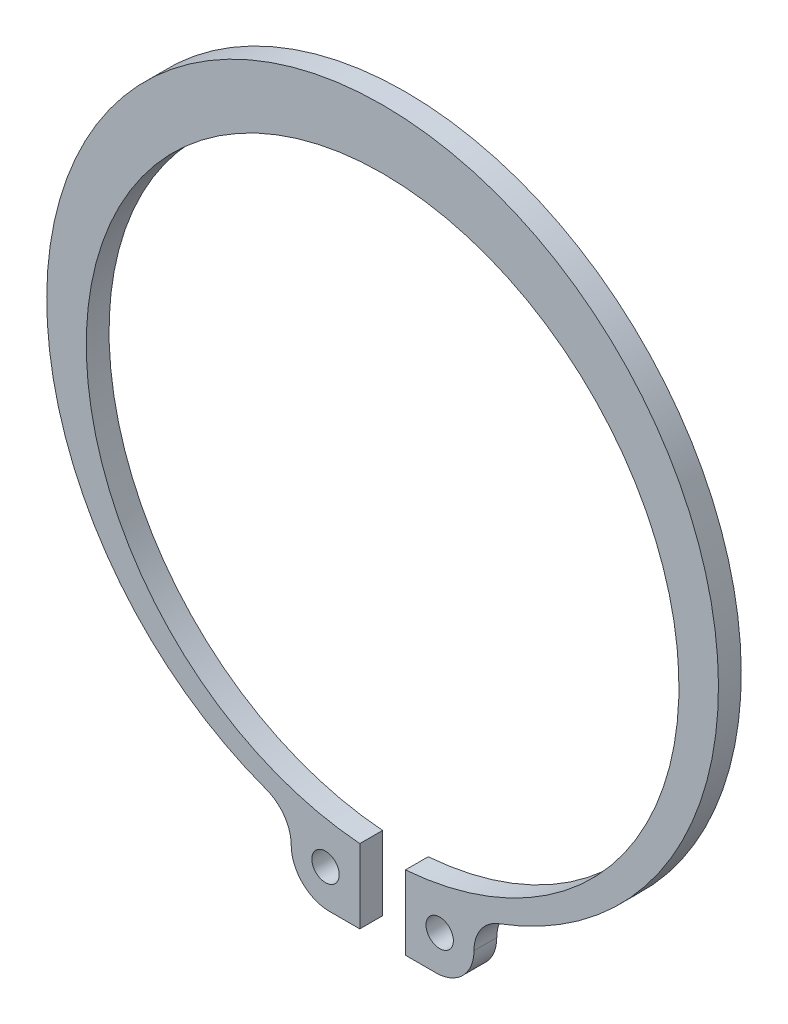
ISO-10303-21;
HEADER;
FILE_DESCRIPTION(('STEP AP214'),'2;1');
FILE_NAME('part.step','',(''),(''),'','','');
FILE_SCHEMA(('AUTOMOTIVE_DESIGN { 1 0 10303 214 1 1 1 1 }'));
ENDSEC;
DATA;
#1=APPLICATION_CONTEXT('core data for automotive mechanical design processes');
#2=APPLICATION_PROTOCOL_DEFINITION('international standard','automotive_design',2000,#1);
#3=PRODUCT_CONTEXT('',#1,'mechanical');
#4=PRODUCT('Part','Part','',(#3));
#5=PRODUCT_RELATED_PRODUCT_CATEGORY('part','',(#4));
#6=PRODUCT_DEFINITION_FORMATION('','',#4);
#7=PRODUCT_DEFINITION_CONTEXT('part definition',#1,'design');
#8=PRODUCT_DEFINITION('design','',#6,#7);
#9=PRODUCT_DEFINITION_SHAPE('','',#8);
#10=(LENGTH_UNIT() NAMED_UNIT(*) SI_UNIT(.MILLI.,.METRE.));
#11=(NAMED_UNIT(*) PLANE_ANGLE_UNIT() SI_UNIT($,.RADIAN.));
#12=(NAMED_UNIT(*) SI_UNIT($,.STERADIAN.) SOLID_ANGLE_UNIT());
#13=UNCERTAINTY_MEASURE_WITH_UNIT(LENGTH_MEASURE(1.E-05),#10,'distance_accuracy_value','');
#14=(GEOMETRIC_REPRESENTATION_CONTEXT(3) GLOBAL_UNCERTAINTY_ASSIGNED_CONTEXT((#13)) GLOBAL_UNIT_ASSIGNED_CONTEXT((#10,
#11,#12)) REPRESENTATION_CONTEXT('',''));
#15=CARTESIAN_POINT('',(0.,0.,0.));
#16=DIRECTION('',(0.,0.,1.));
#17=DIRECTION('',(1.,0.,0.));
#18=AXIS2_PLACEMENT_3D('',#15,#16,#17);
#19=CARTESIAN_POINT('',(-10.0218401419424,-36.3237034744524,0.));
#20=DIRECTION('',(-1.,0.,0.));
#21=DIRECTION('',(0.,0.,1.));
#22=AXIS2_PLACEMENT_3D('',#19,#20,#21);
#23=PLANE('',#22);
#24=DIRECTION('',(0.,1.,0.));
#25=VECTOR('',#24,1.);
#26=CARTESIAN_POINT('',(-10.0218401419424,-36.3237034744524,0.));
#27=LINE('',#26,#25);
#28=CARTESIAN_POINT('',(-10.0218401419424,-36.3137034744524,0.));
#29=VERTEX_POINT('',#28);
#30=CARTESIAN_POINT('',(-10.0218401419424,-36.3237034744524,0.));
#31=VERTEX_POINT('',#30);
#32=EDGE_CURVE('E126',#29,#31,#27,.F.);
#33=ORIENTED_EDGE('',*,*,#32,.T.);
#34=DIRECTION('',(0.,0.,1.));
#35=VECTOR('',#34,1.);
#36=CARTESIAN_POINT('',(-10.0218401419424,-36.3237034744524,0.));
#37=LINE('',#36,#35);
#38=CARTESIAN_POINT('',(-10.0218401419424,-36.3237034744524,2.5));
#39=VERTEX_POINT('',#38);
#40=EDGE_CURVE('E148',#39,#31,#37,.F.);
#41=ORIENTED_EDGE('',*,*,#40,.F.);
#42=DIRECTION('',(0.,1.,0.));
#43=VECTOR('',#42,1.);
#44=CARTESIAN_POINT('',(-10.0218401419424,-3.40089522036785,2.5));
#45=LINE('',#44,#43);
#46=CARTESIAN_POINT('',(-10.0218401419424,-36.3137034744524,2.5));
#47=VERTEX_POINT('',#46);
#48=EDGE_CURVE('E125',#47,#39,#45,.F.);
#49=ORIENTED_EDGE('',*,*,#48,.F.);
#50=DIRECTION('',(0.,0.,1.));
#51=VECTOR('',#50,1.);
#52=CARTESIAN_POINT('',(-10.0218401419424,-36.3137034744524,0.));
#53=LINE('',#52,#51);
#54=EDGE_CURVE('E97',#47,#29,#53,.F.);
#55=ORIENTED_EDGE('',*,*,#54,.T.);
#56=EDGE_LOOP('',(#33,#41,#49,#55));
#57=FACE_BOUND('',#56,.T.);
#58=ADVANCED_FACE('F16',(#57),#23,.T.);
#59=CARTESIAN_POINT('',(10.0218401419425,-36.3137034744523,0.));
#60=DIRECTION('',(1.,0.,0.));
#61=DIRECTION('',(0.,0.,-1.));
#62=AXIS2_PLACEMENT_3D('',#59,#60,#61);
#63=PLANE('',#62);
#64=DIRECTION('',(0.,1.,0.));
#65=VECTOR('',#64,1.);
#66=CARTESIAN_POINT('',(10.0218401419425,-36.3137034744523,0.));
#67=LINE('',#66,#65);
#68=CARTESIAN_POINT('',(10.0218401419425,-36.3237034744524,0.));
#69=VERTEX_POINT('',#68);
#70=CARTESIAN_POINT('',(10.0218401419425,-36.3137034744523,0.));
#71=VERTEX_POINT('',#70);
#72=EDGE_CURVE('E123',#69,#71,#67,.T.);
#73=ORIENTED_EDGE('',*,*,#72,.T.);
#74=DIRECTION('',(0.,0.,1.));
#75=VECTOR('',#74,1.);
#76=CARTESIAN_POINT('',(10.0218401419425,-36.3137034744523,0.));
#77=LINE('',#76,#75);
#78=CARTESIAN_POINT('',(10.0218401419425,-36.3137034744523,2.5));
#79=VERTEX_POINT('',#78);
#80=EDGE_CURVE('E179',#71,#79,#77,.T.);
#81=ORIENTED_EDGE('',*,*,#80,.T.);
#82=DIRECTION('',(0.,1.,0.));
#83=VECTOR('',#82,1.);
#84=CARTESIAN_POINT('',(10.0218401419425,-3.40089522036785,2.5));
#85=LINE('',#84,#83);
#86=CARTESIAN_POINT('',(10.0218401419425,-36.3237034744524,2.5));
#87=VERTEX_POINT('',#86);
#88=EDGE_CURVE('E119',#87,#79,#85,.T.);
#89=ORIENTED_EDGE('',*,*,#88,.F.);
#90=DIRECTION('',(0.,0.,1.));
#91=VECTOR('',#90,1.);
#92=CARTESIAN_POINT('',(10.0218401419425,-36.3237034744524,0.));
#93=LINE('',#92,#91);
#94=EDGE_CURVE('E206',#69,#87,#93,.T.);
#95=ORIENTED_EDGE('',*,*,#94,.F.);
#96=EDGE_LOOP('',(#73,#81,#89,#95));
#97=FACE_BOUND('',#96,.T.);
#98=ADVANCED_FACE('F236',(#97),#63,.T.);
#99=CARTESIAN_POINT('',(0.,-3.40089522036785,2.5));
#100=DIRECTION('',(0.,0.,1.));
#101=DIRECTION('',(1.,0.,0.));
#102=AXIS2_PLACEMENT_3D('',#99,#100,#101);
#103=PLANE('',#102);
#104=CARTESIAN_POINT('',(6.26092007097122,-36.5,2.5));
#105=DIRECTION('',(0.,0.,1.));
#106=DIRECTION('',(1.,0.,0.));
#107=AXIS2_PLACEMENT_3D('',#104,#105,#106);
#108=CIRCLE('',#107,1.5);
#109=CARTESIAN_POINT('',(7.76092007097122,-36.5,2.5));
#110=VERTEX_POINT('',#109);
#111=EDGE_CURVE('E172',#110,#110,#108,.F.);
#112=ORIENTED_EDGE('',*,*,#111,.T.);
#113=EDGE_LOOP('',(#112));
#114=FACE_BOUND('',#113,.T.);
#115=CARTESIAN_POINT('',(-6.26092007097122,-36.5,2.5));
#116=DIRECTION('',(0.,0.,1.));
#117=DIRECTION('',(1.,0.,0.));
#118=AXIS2_PLACEMENT_3D('',#115,#116,#117);
#119=CIRCLE('',#118,1.5);
#120=CARTESIAN_POINT('',(-4.76092007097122,-36.5,2.5));
#121=VERTEX_POINT('',#120);
#122=EDGE_CURVE('E175',#121,#121,#119,.F.);
#123=ORIENTED_EDGE('',*,*,#122,.T.);
#124=EDGE_LOOP('',(#123));
#125=FACE_BOUND('',#124,.T.);
#126=CARTESIAN_POINT('',(5.83554361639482,-36.3237034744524,2.5));
#127=DIRECTION('',(0.,0.,1.));
#128=DIRECTION('',(1.,0.,0.));
#129=AXIS2_PLACEMENT_3D('',#126,#127,#128);
#130=CIRCLE('',#129,4.18629652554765);
#131=CARTESIAN_POINT('',(5.83554361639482,-40.51,2.5));
#132=VERTEX_POINT('',#131);
#133=EDGE_CURVE('E180',#87,#132,#130,.F.);
#134=ORIENTED_EDGE('',*,*,#133,.F.);
#135=ORIENTED_EDGE('',*,*,#88,.T.);
#136=CARTESIAN_POINT('',(14.2081366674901,-36.3137034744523,2.5));
#137=DIRECTION('',(0.,0.,1.));
#138=DIRECTION('',(1.,0.,0.));
#139=AXIS2_PLACEMENT_3D('',#136,#137,#138);
#140=CIRCLE('',#139,4.18629652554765);
#141=CARTESIAN_POINT('',(12.7581120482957,-32.3865534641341,2.5));
#142=VERTEX_POINT('',#141);
#143=EDGE_CURVE('E107',#79,#142,#140,.F.);
#144=ORIENTED_EDGE('',*,*,#143,.T.);
#145=CARTESIAN_POINT('',(0.,2.16666666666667,2.5));
#146=DIRECTION('',(0.,0.,1.));
#147=DIRECTION('',(1.,0.,0.));
#148=AXIS2_PLACEMENT_3D('',#145,#146,#147);
#149=CIRCLE('',#148,36.8333333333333);
#150=CARTESIAN_POINT('',(-12.7581120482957,-32.3865534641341,2.5));
#151=VERTEX_POINT('',#150);
#152=EDGE_CURVE('E103',#151,#142,#149,.F.);
#153=ORIENTED_EDGE('',*,*,#152,.F.);
#154=CARTESIAN_POINT('',(-14.2081366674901,-36.3137034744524,2.5));
#155=DIRECTION('',(0.,0.,1.));
#156=DIRECTION('',(1.,0.,0.));
#157=AXIS2_PLACEMENT_3D('',#154,#155,#156);
#158=CIRCLE('',#157,4.18629652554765);
#159=EDGE_CURVE('E20',#151,#47,#158,.F.);
#160=ORIENTED_EDGE('',*,*,#159,.T.);
#161=ORIENTED_EDGE('',*,*,#48,.T.);
#162=CARTESIAN_POINT('',(-5.83554361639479,-36.3237034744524,2.5));
#163=DIRECTION('',(0.,0.,1.));
#164=DIRECTION('',(1.,0.,0.));
#165=AXIS2_PLACEMENT_3D('',#162,#163,#164);
#166=CIRCLE('',#165,4.18629652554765);
#167=CARTESIAN_POINT('',(-5.83554361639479,-40.51,2.5));
#168=VERTEX_POINT('',#167);
#169=EDGE_CURVE('E116',#168,#39,#166,.F.);
#170=ORIENTED_EDGE('',*,*,#169,.F.);
#171=DIRECTION('',(1.,0.,0.));
#172=VECTOR('',#171,1.);
#173=CARTESIAN_POINT('',(-2.5,-40.51,2.5));
#174=LINE('',#173,#172);
#175=CARTESIAN_POINT('',(-2.50000000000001,-40.51,2.5));
#176=VERTEX_POINT('',#175);
#177=EDGE_CURVE('E146',#176,#168,#174,.F.);
#178=ORIENTED_EDGE('',*,*,#177,.F.);
#179=DIRECTION('',(0.,1.,0.));
#180=VECTOR('',#179,1.);
#181=CARTESIAN_POINT('',(-2.50000000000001,-32.4037034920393,2.5));
#182=LINE('',#181,#180);
#183=CARTESIAN_POINT('',(-2.50000000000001,-32.4037034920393,2.5));
#184=VERTEX_POINT('',#183);
#185=EDGE_CURVE('E139',#184,#176,#182,.F.);
#186=ORIENTED_EDGE('',*,*,#185,.F.);
#187=CARTESIAN_POINT('',(0.,0.,2.5));
#188=DIRECTION('',(0.,0.,1.));
#189=DIRECTION('',(1.,0.,0.));
#190=AXIS2_PLACEMENT_3D('',#187,#188,#189);
#191=CIRCLE('',#190,32.5);
#192=CARTESIAN_POINT('',(2.5,-32.4037034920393,2.5));
#193=VERTEX_POINT('',#192);
#194=EDGE_CURVE('E136',#184,#193,#191,.F.);
#195=ORIENTED_EDGE('',*,*,#194,.T.);
#196=DIRECTION('',(0.,1.,0.));
#197=VECTOR('',#196,1.);
#198=CARTESIAN_POINT('',(2.5,-40.51,2.5));
#199=LINE('',#198,#197);
#200=CARTESIAN_POINT('',(2.5,-40.51,2.5));
#201=VERTEX_POINT('',#200);
#202=EDGE_CURVE('E134',#201,#193,#199,.T.);
#203=ORIENTED_EDGE('',*,*,#202,.F.);
#204=DIRECTION('',(1.,0.,0.));
#205=VECTOR('',#204,1.);
#206=CARTESIAN_POINT('',(5.83554361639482,-40.51,2.5));
#207=LINE('',#206,#205);
#208=EDGE_CURVE('E127',#132,#201,#207,.F.);
#209=ORIENTED_EDGE('',*,*,#208,.F.);
#210=EDGE_LOOP('',(#134,#135,#144,#153,#160,#161,#170,#178,#186,#195,#203,#209));
#211=FACE_BOUND('',#210,.T.);
#212=ADVANCED_FACE('F105',(#114,#125,#211),#103,.T.);
#213=CARTESIAN_POINT('',(-14.2081366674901,-36.3137034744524,0.));
#214=DIRECTION('',(0.,0.,1.));
#215=DIRECTION('',(1.,0.,0.));
#216=AXIS2_PLACEMENT_3D('',#213,#214,#215);
#217=CYLINDRICAL_SURFACE('',#216,4.18629652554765);
#218=DIRECTION('',(0.,0.,1.));
#219=VECTOR('',#218,1.);
#220=CARTESIAN_POINT('',(-12.7581120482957,-32.3865534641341,0.));
#221=LINE('',#220,#219);
#222=CARTESIAN_POINT('',(-12.7581120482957,-32.3865534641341,0.));
#223=VERTEX_POINT('',#222);
#224=EDGE_CURVE('E115',#223,#151,#221,.T.);
#225=ORIENTED_EDGE('',*,*,#224,.F.);
#226=CARTESIAN_POINT('',(-14.2081366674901,-36.3137034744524,0.));
#227=DIRECTION('',(0.,0.,1.));
#228=DIRECTION('',(1.,0.,0.));
#229=AXIS2_PLACEMENT_3D('',#226,#227,#228);
#230=CIRCLE('',#229,4.18629652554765);
#231=EDGE_CURVE('E169',#223,#29,#230,.F.);
#232=ORIENTED_EDGE('',*,*,#231,.T.);
#233=ORIENTED_EDGE('',*,*,#54,.F.);
#234=ORIENTED_EDGE('',*,*,#159,.F.);
#235=EDGE_LOOP('',(#225,#232,#233,#234));
#236=FACE_BOUND('',#235,.T.);
#237=ADVANCED_FACE('F114',(#236),#217,.F.);
#238=CARTESIAN_POINT('',(-5.83554361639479,-36.3237034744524,0.));
#239=DIRECTION('',(0.,0.,1.));
#240=DIRECTION('',(1.,0.,0.));
#241=AXIS2_PLACEMENT_3D('',#238,#239,#240);
#242=CYLINDRICAL_SURFACE('',#241,4.18629652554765);
#243=CARTESIAN_POINT('',(-5.83554361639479,-36.3237034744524,0.));
#244=DIRECTION('',(0.,0.,1.));
#245=DIRECTION('',(1.,0.,0.));
#246=AXIS2_PLACEMENT_3D('',#243,#244,#245);
#247=CIRCLE('',#246,4.18629652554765);
#248=CARTESIAN_POINT('',(-5.83554361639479,-40.51,0.));
#249=VERTEX_POINT('',#248);
#250=EDGE_CURVE('E165',#31,#249,#247,.T.);
#251=ORIENTED_EDGE('',*,*,#250,.T.);
#252=DIRECTION('',(0.,0.,-1.));
#253=VECTOR('',#252,1.);
#254=CARTESIAN_POINT('',(-5.83554361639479,-40.51,0.));
#255=LINE('',#254,#253);
#256=EDGE_CURVE('E143',#168,#249,#255,.T.);
#257=ORIENTED_EDGE('',*,*,#256,.F.);
#258=ORIENTED_EDGE('',*,*,#169,.T.);
#259=ORIENTED_EDGE('',*,*,#40,.T.);
#260=EDGE_LOOP('',(#251,#257,#258,#259));
#261=FACE_BOUND('',#260,.T.);
#262=ADVANCED_FACE('F261',(#261),#242,.T.);
#263=CARTESIAN_POINT('',(-2.5,-40.51,0.));
#264=DIRECTION('',(0.,-1.,0.));
#265=DIRECTION('',(0.,0.,-1.));
#266=AXIS2_PLACEMENT_3D('',#263,#264,#265);
#267=PLANE('',#266);
#268=DIRECTION('',(1.,0.,0.));
#269=VECTOR('',#268,1.);
#270=CARTESIAN_POINT('',(0.,-40.51,0.));
#271=LINE('',#270,#269);
#272=CARTESIAN_POINT('',(-2.5,-40.51,0.));
#273=VERTEX_POINT('',#272);
#274=EDGE_CURVE('E168',#249,#273,#271,.T.);
#275=ORIENTED_EDGE('',*,*,#274,.T.);
#276=DIRECTION('',(0.,0.,-1.));
#277=VECTOR('',#276,1.);
#278=CARTESIAN_POINT('',(-2.50000000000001,-40.51,0.));
#279=LINE('',#278,#277);
#280=EDGE_CURVE('E142',#176,#273,#279,.T.);
#281=ORIENTED_EDGE('',*,*,#280,.F.);
#282=ORIENTED_EDGE('',*,*,#177,.T.);
#283=ORIENTED_EDGE('',*,*,#256,.T.);
#284=EDGE_LOOP('',(#275,#281,#282,#283));
#285=FACE_BOUND('',#284,.T.);
#286=ADVANCED_FACE('F258',(#285),#267,.T.);
#287=CARTESIAN_POINT('',(-2.50000000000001,-32.4037034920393,0.));
#288=DIRECTION('',(1.,0.,0.));
#289=DIRECTION('',(0.,0.,-1.));
#290=AXIS2_PLACEMENT_3D('',#287,#288,#289);
#291=PLANE('',#290);
#292=DIRECTION('',(0.,1.,0.));
#293=VECTOR('',#292,1.);
#294=CARTESIAN_POINT('',(-2.5,-3.40089522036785,0.));
#295=LINE('',#294,#293);
#296=CARTESIAN_POINT('',(-2.5,-32.4037034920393,0.));
#297=VERTEX_POINT('',#296);
#298=EDGE_CURVE('E164',#273,#297,#295,.T.);
#299=ORIENTED_EDGE('',*,*,#298,.T.);
#300=DIRECTION('',(0.,0.,1.));
#301=VECTOR('',#300,1.);
#302=CARTESIAN_POINT('',(-2.50000000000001,-32.4037034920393,0.));
#303=LINE('',#302,#301);
#304=EDGE_CURVE('E184',#297,#184,#303,.T.);
#305=ORIENTED_EDGE('',*,*,#304,.T.);
#306=ORIENTED_EDGE('',*,*,#185,.T.);
#307=ORIENTED_EDGE('',*,*,#280,.T.);
#308=EDGE_LOOP('',(#299,#305,#306,#307));
#309=FACE_BOUND('',#308,.T.);
#310=ADVANCED_FACE('F254',(#309),#291,.T.);
#311=CARTESIAN_POINT('',(0.,0.,0.));
#312=DIRECTION('',(0.,0.,1.));
#313=DIRECTION('',(1.,0.,0.));
#314=AXIS2_PLACEMENT_3D('',#311,#312,#313);
#315=CYLINDRICAL_SURFACE('',#314,32.5);
#316=CARTESIAN_POINT('',(0.,0.,0.));
#317=DIRECTION('',(0.,0.,1.));
#318=DIRECTION('',(1.,0.,0.));
#319=AXIS2_PLACEMENT_3D('',#316,#317,#318);
#320=CIRCLE('',#319,32.5);
#321=CARTESIAN_POINT('',(2.50000000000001,-32.4037034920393,0.));
#322=VERTEX_POINT('',#321);
#323=EDGE_CURVE('E161',#297,#322,#320,.F.);
#324=ORIENTED_EDGE('',*,*,#323,.T.);
#325=DIRECTION('',(0.,0.,1.));
#326=VECTOR('',#325,1.);
#327=CARTESIAN_POINT('',(2.5,-32.4037034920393,0.));
#328=LINE('',#327,#326);
#329=EDGE_CURVE('E131',#193,#322,#328,.F.);
#330=ORIENTED_EDGE('',*,*,#329,.F.);
#331=ORIENTED_EDGE('',*,*,#194,.F.);
#332=ORIENTED_EDGE('',*,*,#304,.F.);
#333=EDGE_LOOP('',(#324,#330,#331,#332));
#334=FACE_BOUND('',#333,.T.);
#335=ADVANCED_FACE('F298',(#334),#315,.F.);
#336=CARTESIAN_POINT('',(2.5,-40.51,0.));
#337=DIRECTION('',(-1.,0.,0.));
#338=DIRECTION('',(0.,0.,1.));
#339=AXIS2_PLACEMENT_3D('',#336,#337,#338);
#340=PLANE('',#339);
#341=DIRECTION('',(0.,1.,0.));
#342=VECTOR('',#341,1.);
#343=CARTESIAN_POINT('',(2.50000000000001,-3.40089522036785,0.));
#344=LINE('',#343,#342);
#345=CARTESIAN_POINT('',(2.50000000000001,-40.51,0.));
#346=VERTEX_POINT('',#345);
#347=EDGE_CURVE('E163',#322,#346,#344,.F.);
#348=ORIENTED_EDGE('',*,*,#347,.T.);
#349=DIRECTION('',(0.,0.,-1.));
#350=VECTOR('',#349,1.);
#351=CARTESIAN_POINT('',(2.5,-40.51,0.));
#352=LINE('',#351,#350);
#353=EDGE_CURVE('E130',#201,#346,#352,.T.);
#354=ORIENTED_EDGE('',*,*,#353,.F.);
#355=ORIENTED_EDGE('',*,*,#202,.T.);
#356=ORIENTED_EDGE('',*,*,#329,.T.);
#357=EDGE_LOOP('',(#348,#354,#355,#356));
#358=FACE_BOUND('',#357,.T.);
#359=ADVANCED_FACE('F248',(#358),#340,.T.);
#360=CARTESIAN_POINT('',(5.83554361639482,-40.51,0.));
#361=DIRECTION('',(0.,-1.,0.));
#362=DIRECTION('',(0.,0.,-1.));
#363=AXIS2_PLACEMENT_3D('',#360,#361,#362);
#364=PLANE('',#363);
#365=DIRECTION('',(1.,0.,0.));
#366=VECTOR('',#365,1.);
#367=CARTESIAN_POINT('',(0.,-40.51,0.));
#368=LINE('',#367,#366);
#369=CARTESIAN_POINT('',(5.83554361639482,-40.51,0.));
#370=VERTEX_POINT('',#369);
#371=EDGE_CURVE('E160',#346,#370,#368,.T.);
#372=ORIENTED_EDGE('',*,*,#371,.T.);
#373=DIRECTION('',(0.,0.,1.));
#374=VECTOR('',#373,1.);
#375=CARTESIAN_POINT('',(5.83554361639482,-40.51,0.));
#376=LINE('',#375,#374);
#377=EDGE_CURVE('E182',#132,#370,#376,.F.);
#378=ORIENTED_EDGE('',*,*,#377,.F.);
#379=ORIENTED_EDGE('',*,*,#208,.T.);
#380=ORIENTED_EDGE('',*,*,#353,.T.);
#381=EDGE_LOOP('',(#372,#378,#379,#380));
#382=FACE_BOUND('',#381,.T.);
#383=ADVANCED_FACE('F243',(#382),#364,.T.);
#384=CARTESIAN_POINT('',(5.83554361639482,-36.3237034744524,0.));
#385=DIRECTION('',(0.,0.,1.));
#386=DIRECTION('',(1.,0.,0.));
#387=AXIS2_PLACEMENT_3D('',#384,#385,#386);
#388=CYLINDRICAL_SURFACE('',#387,4.18629652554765);
#389=CARTESIAN_POINT('',(5.83554361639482,-36.3237034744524,0.));
#390=DIRECTION('',(0.,0.,1.));
#391=DIRECTION('',(1.,0.,0.));
#392=AXIS2_PLACEMENT_3D('',#389,#390,#391);
#393=CIRCLE('',#392,4.18629652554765);
#394=EDGE_CURVE('E157',#370,#69,#393,.T.);
#395=ORIENTED_EDGE('',*,*,#394,.T.);
#396=ORIENTED_EDGE('',*,*,#94,.T.);
#397=ORIENTED_EDGE('',*,*,#133,.T.);
#398=ORIENTED_EDGE('',*,*,#377,.T.);
#399=EDGE_LOOP('',(#395,#396,#397,#398));
#400=FACE_BOUND('',#399,.T.);
#401=ADVANCED_FACE('F291',(#400),#388,.T.);
#402=CARTESIAN_POINT('',(14.2081366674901,-36.3137034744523,0.));
#403=DIRECTION('',(0.,0.,1.));
#404=DIRECTION('',(1.,0.,0.));
#405=AXIS2_PLACEMENT_3D('',#402,#403,#404);
#406=CYLINDRICAL_SURFACE('',#405,4.18629652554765);
#407=ORIENTED_EDGE('',*,*,#80,.F.);
#408=CARTESIAN_POINT('',(14.2081366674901,-36.3137034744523,0.));
#409=DIRECTION('',(0.,0.,1.));
#410=DIRECTION('',(1.,0.,0.));
#411=AXIS2_PLACEMENT_3D('',#408,#409,#410);
#412=CIRCLE('',#411,4.18629652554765);
#413=CARTESIAN_POINT('',(12.7581120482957,-32.3865534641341,0.));
#414=VERTEX_POINT('',#413);
#415=EDGE_CURVE('E154',#71,#414,#412,.F.);
#416=ORIENTED_EDGE('',*,*,#415,.T.);
#417=DIRECTION('',(0.,0.,1.));
#418=VECTOR('',#417,1.);
#419=CARTESIAN_POINT('',(12.7581120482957,-32.3865534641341,0.));
#420=LINE('',#419,#418);
#421=EDGE_CURVE('E111',#142,#414,#420,.F.);
#422=ORIENTED_EDGE('',*,*,#421,.F.);
#423=ORIENTED_EDGE('',*,*,#143,.F.);
#424=EDGE_LOOP('',(#407,#416,#422,#423));
#425=FACE_BOUND('',#424,.T.);
#426=ADVANCED_FACE('F235',(#425),#406,.F.);
#427=CARTESIAN_POINT('',(0.,2.16666666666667,0.));
#428=DIRECTION('',(0.,0.,1.));
#429=DIRECTION('',(1.,0.,0.));
#430=AXIS2_PLACEMENT_3D('',#427,#428,#429);
#431=CYLINDRICAL_SURFACE('',#430,36.8333333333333);
#432=ORIENTED_EDGE('',*,*,#421,.T.);
#433=CARTESIAN_POINT('',(0.,2.16666666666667,0.));
#434=DIRECTION('',(0.,0.,1.));
#435=DIRECTION('',(1.,0.,0.));
#436=AXIS2_PLACEMENT_3D('',#433,#434,#435);
#437=CIRCLE('',#436,36.8333333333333);
#438=EDGE_CURVE('E35',#414,#223,#437,.T.);
#439=ORIENTED_EDGE('',*,*,#438,.T.);
#440=ORIENTED_EDGE('',*,*,#224,.T.);
#441=ORIENTED_EDGE('',*,*,#152,.T.);
#442=EDGE_LOOP('',(#432,#439,#440,#441));
#443=FACE_BOUND('',#442,.T.);
#444=ADVANCED_FACE('F117',(#443),#431,.T.);
#445=CARTESIAN_POINT('',(-6.26092007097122,-36.5,1.25));
#446=DIRECTION('',(0.,0.,1.));
#447=DIRECTION('',(1.,0.,0.));
#448=AXIS2_PLACEMENT_3D('',#445,#446,#447);
#449=CYLINDRICAL_SURFACE('',#448,1.5);
#450=ORIENTED_EDGE('',*,*,#122,.F.);
#451=EDGE_LOOP('',(#450));
#452=FACE_BOUND('',#451,.T.);
#453=CARTESIAN_POINT('',(-6.26092007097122,-36.5,0.));
#454=DIRECTION('',(0.,0.,1.));
#455=DIRECTION('',(1.,0.,0.));
#456=AXIS2_PLACEMENT_3D('',#453,#454,#455);
#457=CIRCLE('',#456,1.5);
#458=CARTESIAN_POINT('',(-4.76092007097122,-36.5,0.));
#459=VERTEX_POINT('',#458);
#460=EDGE_CURVE('E26',#459,#459,#457,.F.);
#461=ORIENTED_EDGE('',*,*,#460,.T.);
#462=EDGE_LOOP('',(#461));
#463=FACE_BOUND('',#462,.T.);
#464=ADVANCED_FACE('F275',(#452,#463),#449,.F.);
#465=CARTESIAN_POINT('',(6.26092007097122,-36.5,1.25));
#466=DIRECTION('',(0.,0.,1.));
#467=DIRECTION('',(1.,0.,0.));
#468=AXIS2_PLACEMENT_3D('',#465,#466,#467);
#469=CYLINDRICAL_SURFACE('',#468,1.5);
#470=ORIENTED_EDGE('',*,*,#111,.F.);
#471=EDGE_LOOP('',(#470));
#472=FACE_BOUND('',#471,.T.);
#473=CARTESIAN_POINT('',(6.26092007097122,-36.5,0.));
#474=DIRECTION('',(0.,0.,1.));
#475=DIRECTION('',(1.,0.,0.));
#476=AXIS2_PLACEMENT_3D('',#473,#474,#475);
#477=CIRCLE('',#476,1.5);
#478=CARTESIAN_POINT('',(7.76092007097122,-36.5,0.));
#479=VERTEX_POINT('',#478);
#480=EDGE_CURVE('E10',#479,#479,#477,.F.);
#481=ORIENTED_EDGE('',*,*,#480,.T.);
#482=EDGE_LOOP('',(#481));
#483=FACE_BOUND('',#482,.T.);
#484=ADVANCED_FACE('F271',(#472,#483),#469,.F.);
#485=CARTESIAN_POINT('',(0.,-3.40089522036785,0.));
#486=DIRECTION('',(0.,0.,1.));
#487=DIRECTION('',(1.,0.,0.));
#488=AXIS2_PLACEMENT_3D('',#485,#486,#487);
#489=PLANE('',#488);
#490=ORIENTED_EDGE('',*,*,#480,.F.);
#491=EDGE_LOOP('',(#490));
#492=FACE_BOUND('',#491,.T.);
#493=ORIENTED_EDGE('',*,*,#460,.F.);
#494=EDGE_LOOP('',(#493));
#495=FACE_BOUND('',#494,.T.);
#496=ORIENTED_EDGE('',*,*,#415,.F.);
#497=ORIENTED_EDGE('',*,*,#72,.F.);
#498=ORIENTED_EDGE('',*,*,#394,.F.);
#499=ORIENTED_EDGE('',*,*,#371,.F.);
#500=ORIENTED_EDGE('',*,*,#347,.F.);
#501=ORIENTED_EDGE('',*,*,#323,.F.);
#502=ORIENTED_EDGE('',*,*,#298,.F.);
#503=ORIENTED_EDGE('',*,*,#274,.F.);
#504=ORIENTED_EDGE('',*,*,#250,.F.);
#505=ORIENTED_EDGE('',*,*,#32,.F.);
#506=ORIENTED_EDGE('',*,*,#231,.F.);
#507=ORIENTED_EDGE('',*,*,#438,.F.);
#508=EDGE_LOOP('',(#496,#497,#498,#499,#500,#501,#502,#503,#504,#505,#506,#507));
#509=FACE_BOUND('',#508,.T.);
#510=ADVANCED_FACE('F18',(#492,#495,#509),#489,.F.);
#511=CLOSED_SHELL('',(#58,#98,#212,#237,#262,#286,#310,#335,#359,#383,#401,#426,#444,#464,#484,#510));
#512=MANIFOLD_SOLID_BREP('B1',#511);
#513=ADVANCED_BREP_SHAPE_REPRESENTATION('',(#18,#512),#14);
#514=SHAPE_DEFINITION_REPRESENTATION(#9,#513);
ENDSEC;
END-ISO-10303-21;
